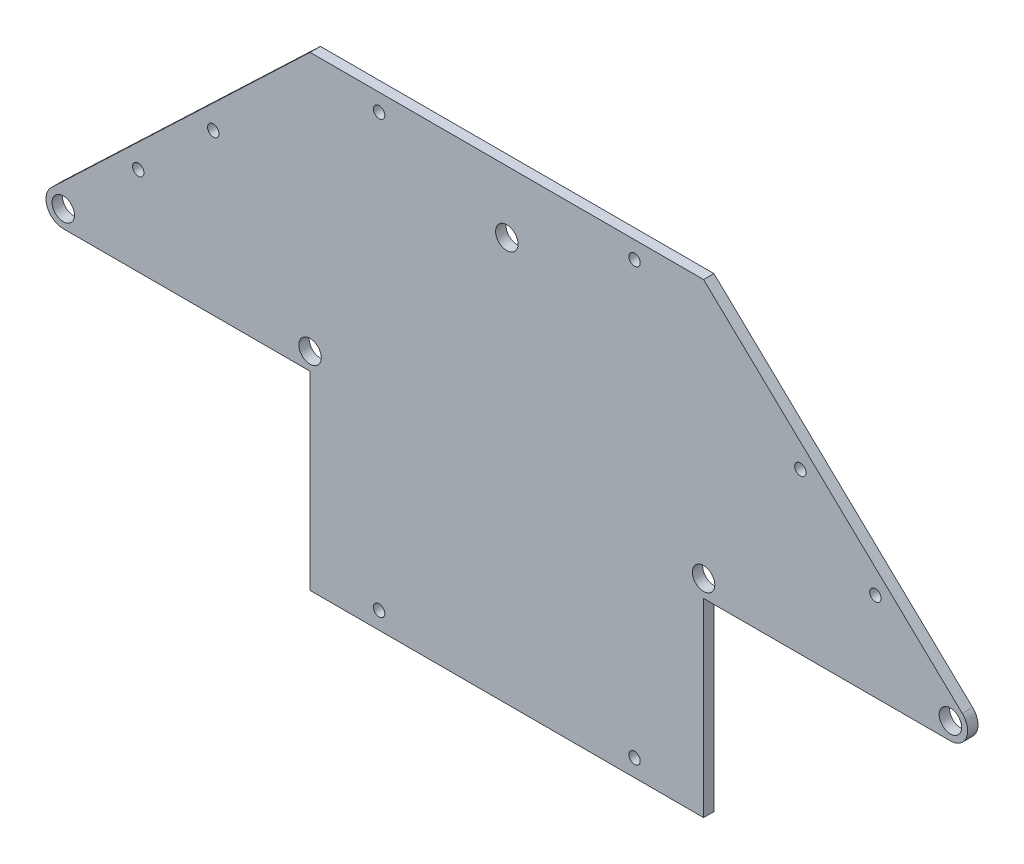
ISO-10303-21;
HEADER;
FILE_DESCRIPTION(('STEP AP214'),'2;1');
FILE_NAME('part.step','',(''),(''),'','','');
FILE_SCHEMA(('AUTOMOTIVE_DESIGN { 1 0 10303 214 1 1 1 1 }'));
ENDSEC;
DATA;
#1=APPLICATION_CONTEXT('core data for automotive mechanical design processes');
#2=APPLICATION_PROTOCOL_DEFINITION('international standard','automotive_design',2000,#1);
#3=PRODUCT_CONTEXT('',#1,'mechanical');
#4=PRODUCT('Part','Part','',(#3));
#5=PRODUCT_RELATED_PRODUCT_CATEGORY('part','',(#4));
#6=PRODUCT_DEFINITION_FORMATION('','',#4);
#7=PRODUCT_DEFINITION_CONTEXT('part definition',#1,'design');
#8=PRODUCT_DEFINITION('design','',#6,#7);
#9=PRODUCT_DEFINITION_SHAPE('','',#8);
#10=(LENGTH_UNIT() NAMED_UNIT(*) SI_UNIT(.MILLI.,.METRE.));
#11=(NAMED_UNIT(*) PLANE_ANGLE_UNIT() SI_UNIT($,.RADIAN.));
#12=(NAMED_UNIT(*) SI_UNIT($,.STERADIAN.) SOLID_ANGLE_UNIT());
#13=UNCERTAINTY_MEASURE_WITH_UNIT(LENGTH_MEASURE(1.E-05),#10,'distance_accuracy_value','');
#14=(GEOMETRIC_REPRESENTATION_CONTEXT(3) GLOBAL_UNCERTAINTY_ASSIGNED_CONTEXT((#13)) GLOBAL_UNIT_ASSIGNED_CONTEXT((#10,
#11,#12)) REPRESENTATION_CONTEXT('',''));
#15=CARTESIAN_POINT('',(0.,0.,0.));
#16=DIRECTION('',(0.,0.,1.));
#17=DIRECTION('',(1.,0.,0.));
#18=AXIS2_PLACEMENT_3D('',#15,#16,#17);
#19=CARTESIAN_POINT('',(0.,0.,3.));
#20=DIRECTION('',(0.,0.,-1.));
#21=DIRECTION('',(-1.,0.,0.));
#22=AXIS2_PLACEMENT_3D('',#19,#20,#21);
#23=PLANE('',#22);
#24=CARTESIAN_POINT('',(21.7241379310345,20.6896551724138,3.));
#25=DIRECTION('',(0.,0.,1.));
#26=DIRECTION('',(1.,0.,0.));
#27=AXIS2_PLACEMENT_3D('',#24,#25,#26);
#28=CIRCLE('',#27,1.65);
#29=CARTESIAN_POINT('',(23.3741379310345,20.6896551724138,3.));
#30=VERTEX_POINT('',#29);
#31=EDGE_CURVE('E270',#30,#30,#28,.T.);
#32=ORIENTED_EDGE('',*,*,#31,.F.);
#33=EDGE_LOOP('',(#32));
#34=FACE_BOUND('',#33,.T.);
#35=CARTESIAN_POINT('',(91.5,-55.,3.));
#36=DIRECTION('',(0.,0.,1.));
#37=DIRECTION('',(1.,0.,0.));
#38=AXIS2_PLACEMENT_3D('',#35,#36,#37);
#39=CIRCLE('',#38,1.65);
#40=CARTESIAN_POINT('',(93.15,-55.,3.));
#41=VERTEX_POINT('',#40);
#42=EDGE_CURVE('E258',#41,#41,#39,.T.);
#43=ORIENTED_EDGE('',*,*,#42,.F.);
#44=EDGE_LOOP('',(#43));
#45=FACE_BOUND('',#44,.T.);
#46=CARTESIAN_POINT('',(165.5,70.,3.));
#47=DIRECTION('',(0.,0.,1.));
#48=DIRECTION('',(1.,0.,0.));
#49=AXIS2_PLACEMENT_3D('',#46,#47,#48);
#50=CIRCLE('',#49,1.65000000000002);
#51=CARTESIAN_POINT('',(167.15,70.,3.));
#52=VERTEX_POINT('',#51);
#53=EDGE_CURVE('E246',#52,#52,#50,.T.);
#54=ORIENTED_EDGE('',*,*,#53,.F.);
#55=EDGE_LOOP('',(#54));
#56=FACE_BOUND('',#55,.T.);
#57=CARTESIAN_POINT('',(43.448275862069,41.3793103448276,3.));
#58=DIRECTION('',(0.,0.,1.));
#59=DIRECTION('',(1.,0.,0.));
#60=AXIS2_PLACEMENT_3D('',#57,#58,#59);
#61=CIRCLE('',#60,1.65);
#62=CARTESIAN_POINT('',(45.098275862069,41.3793103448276,3.));
#63=VERTEX_POINT('',#62);
#64=EDGE_CURVE('E234',#63,#63,#61,.T.);
#65=ORIENTED_EDGE('',*,*,#64,.F.);
#66=EDGE_LOOP('',(#65));
#67=FACE_BOUND('',#66,.T.);
#68=CARTESIAN_POINT('',(185.5,0.,3.));
#69=DIRECTION('',(0.,0.,1.));
#70=DIRECTION('',(1.,0.,0.));
#71=AXIS2_PLACEMENT_3D('',#68,#69,#70);
#72=CIRCLE('',#71,3.25000000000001);
#73=CARTESIAN_POINT('',(188.75,0.,3.));
#74=VERTEX_POINT('',#73);
#75=EDGE_CURVE('E222',#74,#74,#72,.T.);
#76=ORIENTED_EDGE('',*,*,#75,.F.);
#77=EDGE_LOOP('',(#76));
#78=FACE_BOUND('',#77,.T.);
#79=CARTESIAN_POINT('',(257.,0.,3.));
#80=DIRECTION('',(0.,0.,1.));
#81=DIRECTION('',(1.,0.,0.));
#82=AXIS2_PLACEMENT_3D('',#79,#80,#81);
#83=CIRCLE('',#82,3.24999999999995);
#84=CARTESIAN_POINT('',(260.25,0.,3.));
#85=VERTEX_POINT('',#84);
#86=EDGE_CURVE('E210',#85,#85,#83,.T.);
#87=ORIENTED_EDGE('',*,*,#86,.F.);
#88=EDGE_LOOP('',(#87));
#89=FACE_BOUND('',#88,.T.);
#90=CARTESIAN_POINT('',(0.,0.,3.));
#91=DIRECTION('',(0.,0.,1.));
#92=DIRECTION('',(-1.,0.,0.));
#93=AXIS2_PLACEMENT_3D('',#90,#91,#92);
#94=CIRCLE('',#93,5.);
#95=CARTESIAN_POINT('',(-3.44827586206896,3.62068965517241,3.));
#96=VERTEX_POINT('',#95);
#97=CARTESIAN_POINT('',(0.,-5.,3.));
#98=VERTEX_POINT('',#97);
#99=EDGE_CURVE('E159',#96,#98,#94,.T.);
#100=ORIENTED_EDGE('',*,*,#99,.T.);
#101=DIRECTION('',(1.,0.,0.));
#102=VECTOR('',#101,1.);
#103=CARTESIAN_POINT('',(0.,-5.,3.));
#104=LINE('',#103,#102);
#105=CARTESIAN_POINT('',(71.5,-5.,3.));
#106=VERTEX_POINT('',#105);
#107=EDGE_CURVE('E97',#98,#106,#104,.T.);
#108=ORIENTED_EDGE('',*,*,#107,.T.);
#109=DIRECTION('',(0.,-1.,0.));
#110=VECTOR('',#109,1.);
#111=CARTESIAN_POINT('',(71.5,-5.,3.));
#112=LINE('',#111,#110);
#113=CARTESIAN_POINT('',(71.5,-60.,3.));
#114=VERTEX_POINT('',#113);
#115=EDGE_CURVE('E180',#106,#114,#112,.T.);
#116=ORIENTED_EDGE('',*,*,#115,.T.);
#117=DIRECTION('',(1.,0.,0.));
#118=VECTOR('',#117,1.);
#119=CARTESIAN_POINT('',(71.5,-60.,3.));
#120=LINE('',#119,#118);
#121=CARTESIAN_POINT('',(185.5,-60.,3.));
#122=VERTEX_POINT('',#121);
#123=EDGE_CURVE('E199',#114,#122,#120,.T.);
#124=ORIENTED_EDGE('',*,*,#123,.T.);
#125=DIRECTION('',(0.,1.,0.));
#126=VECTOR('',#125,1.);
#127=CARTESIAN_POINT('',(185.5,-60.,3.));
#128=LINE('',#127,#126);
#129=CARTESIAN_POINT('',(185.5,-5.,3.));
#130=VERTEX_POINT('',#129);
#131=EDGE_CURVE('E196',#122,#130,#128,.T.);
#132=ORIENTED_EDGE('',*,*,#131,.T.);
#133=DIRECTION('',(1.,0.,0.));
#134=VECTOR('',#133,1.);
#135=CARTESIAN_POINT('',(185.5,-5.,3.));
#136=LINE('',#135,#134);
#137=CARTESIAN_POINT('',(257.,-5.,3.));
#138=VERTEX_POINT('',#137);
#139=EDGE_CURVE('E198',#130,#138,#136,.T.);
#140=ORIENTED_EDGE('',*,*,#139,.T.);
#141=CARTESIAN_POINT('',(257.,0.,3.));
#142=DIRECTION('',(0.,0.,1.));
#143=DIRECTION('',(1.,0.,0.));
#144=AXIS2_PLACEMENT_3D('',#141,#142,#143);
#145=CIRCLE('',#144,5.00000000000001);
#146=CARTESIAN_POINT('',(260.448275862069,3.62068965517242,3.));
#147=VERTEX_POINT('',#146);
#148=EDGE_CURVE('E122',#138,#147,#145,.T.);
#149=ORIENTED_EDGE('',*,*,#148,.T.);
#150=DIRECTION('',(-0.724137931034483,0.689655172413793,0.));
#151=VECTOR('',#150,1.);
#152=CARTESIAN_POINT('',(185.5,75.,3.));
#153=LINE('',#152,#151);
#154=CARTESIAN_POINT('',(185.5,75.,3.));
#155=VERTEX_POINT('',#154);
#156=EDGE_CURVE('E116',#147,#155,#153,.T.);
#157=ORIENTED_EDGE('',*,*,#156,.T.);
#158=DIRECTION('',(-1.,0.,0.));
#159=VECTOR('',#158,1.);
#160=CARTESIAN_POINT('',(71.5,75.,3.));
#161=LINE('',#160,#159);
#162=CARTESIAN_POINT('',(71.5,75.,3.));
#163=VERTEX_POINT('',#162);
#164=EDGE_CURVE('E120',#155,#163,#161,.T.);
#165=ORIENTED_EDGE('',*,*,#164,.T.);
#166=DIRECTION('',(-0.724137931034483,-0.689655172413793,0.));
#167=VECTOR('',#166,1.);
#168=CARTESIAN_POINT('',(71.5,75.,3.));
#169=LINE('',#168,#167);
#170=EDGE_CURVE('E48',#163,#96,#169,.T.);
#171=ORIENTED_EDGE('',*,*,#170,.T.);
#172=EDGE_LOOP('',(#100,#108,#116,#124,#132,#140,#149,#157,#165,#171));
#173=FACE_BOUND('',#172,.T.);
#174=CARTESIAN_POINT('',(0.,0.,3.));
#175=DIRECTION('',(0.,0.,1.));
#176=DIRECTION('',(1.,0.,0.));
#177=AXIS2_PLACEMENT_3D('',#174,#175,#176);
#178=CIRCLE('',#177,3.25);
#179=CARTESIAN_POINT('',(3.25,0.,3.));
#180=VERTEX_POINT('',#179);
#181=EDGE_CURVE('E144',#180,#180,#178,.T.);
#182=ORIENTED_EDGE('',*,*,#181,.F.);
#183=EDGE_LOOP('',(#182));
#184=FACE_BOUND('',#183,.T.);
#185=CARTESIAN_POINT('',(71.5,0.,3.));
#186=DIRECTION('',(0.,0.,1.));
#187=DIRECTION('',(1.,0.,0.));
#188=AXIS2_PLACEMENT_3D('',#185,#186,#187);
#189=CIRCLE('',#188,3.25000000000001);
#190=CARTESIAN_POINT('',(74.75,0.,3.));
#191=VERTEX_POINT('',#190);
#192=EDGE_CURVE('E216',#191,#191,#189,.T.);
#193=ORIENTED_EDGE('',*,*,#192,.F.);
#194=EDGE_LOOP('',(#193));
#195=FACE_BOUND('',#194,.T.);
#196=CARTESIAN_POINT('',(128.5,57.,3.));
#197=DIRECTION('',(0.,0.,1.));
#198=DIRECTION('',(1.,0.,0.));
#199=AXIS2_PLACEMENT_3D('',#196,#197,#198);
#200=CIRCLE('',#199,3.25000000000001);
#201=CARTESIAN_POINT('',(131.75,57.,3.));
#202=VERTEX_POINT('',#201);
#203=EDGE_CURVE('E228',#202,#202,#200,.T.);
#204=ORIENTED_EDGE('',*,*,#203,.F.);
#205=EDGE_LOOP('',(#204));
#206=FACE_BOUND('',#205,.T.);
#207=CARTESIAN_POINT('',(91.5,70.,3.));
#208=DIRECTION('',(0.,0.,1.));
#209=DIRECTION('',(1.,0.,0.));
#210=AXIS2_PLACEMENT_3D('',#207,#208,#209);
#211=CIRCLE('',#210,1.65);
#212=CARTESIAN_POINT('',(93.15,70.,3.));
#213=VERTEX_POINT('',#212);
#214=EDGE_CURVE('E240',#213,#213,#211,.T.);
#215=ORIENTED_EDGE('',*,*,#214,.F.);
#216=EDGE_LOOP('',(#215));
#217=FACE_BOUND('',#216,.T.);
#218=CARTESIAN_POINT('',(213.551724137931,41.3793103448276,3.));
#219=DIRECTION('',(0.,0.,1.));
#220=DIRECTION('',(1.,0.,0.));
#221=AXIS2_PLACEMENT_3D('',#218,#219,#220);
#222=CIRCLE('',#221,1.65000000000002);
#223=CARTESIAN_POINT('',(215.201724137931,41.3793103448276,3.));
#224=VERTEX_POINT('',#223);
#225=EDGE_CURVE('E252',#224,#224,#222,.T.);
#226=ORIENTED_EDGE('',*,*,#225,.F.);
#227=EDGE_LOOP('',(#226));
#228=FACE_BOUND('',#227,.T.);
#229=CARTESIAN_POINT('',(165.5,-55.,3.));
#230=DIRECTION('',(0.,0.,1.));
#231=DIRECTION('',(1.,0.,0.));
#232=AXIS2_PLACEMENT_3D('',#229,#230,#231);
#233=CIRCLE('',#232,1.65000000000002);
#234=CARTESIAN_POINT('',(167.15,-55.,3.));
#235=VERTEX_POINT('',#234);
#236=EDGE_CURVE('E264',#235,#235,#233,.T.);
#237=ORIENTED_EDGE('',*,*,#236,.F.);
#238=EDGE_LOOP('',(#237));
#239=FACE_BOUND('',#238,.T.);
#240=CARTESIAN_POINT('',(235.275862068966,20.6896551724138,3.));
#241=DIRECTION('',(0.,0.,1.));
#242=DIRECTION('',(1.,0.,0.));
#243=AXIS2_PLACEMENT_3D('',#240,#241,#242);
#244=CIRCLE('',#243,1.65000000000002);
#245=CARTESIAN_POINT('',(236.925862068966,20.6896551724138,3.));
#246=VERTEX_POINT('',#245);
#247=EDGE_CURVE('E276',#246,#246,#244,.T.);
#248=ORIENTED_EDGE('',*,*,#247,.F.);
#249=EDGE_LOOP('',(#248));
#250=FACE_BOUND('',#249,.T.);
#251=ADVANCED_FACE('F31',(#34,#45,#56,#67,#78,#89,#173,#184,#195,#206,#217,#228,#239,#250),#23,.F.);
#252=CARTESIAN_POINT('',(0.,0.,0.));
#253=DIRECTION('',(0.,0.,-1.));
#254=DIRECTION('',(-1.,0.,0.));
#255=AXIS2_PLACEMENT_3D('',#252,#253,#254);
#256=PLANE('',#255);
#257=CARTESIAN_POINT('',(21.7241379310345,20.6896551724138,0.));
#258=DIRECTION('',(0.,0.,1.));
#259=DIRECTION('',(1.,0.,0.));
#260=AXIS2_PLACEMENT_3D('',#257,#258,#259);
#261=CIRCLE('',#260,1.65);
#262=CARTESIAN_POINT('',(23.3741379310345,20.6896551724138,0.));
#263=VERTEX_POINT('',#262);
#264=EDGE_CURVE('E273',#263,#263,#261,.T.);
#265=ORIENTED_EDGE('',*,*,#264,.T.);
#266=EDGE_LOOP('',(#265));
#267=FACE_BOUND('',#266,.T.);
#268=CARTESIAN_POINT('',(91.5,-55.,0.));
#269=DIRECTION('',(0.,0.,1.));
#270=DIRECTION('',(1.,0.,0.));
#271=AXIS2_PLACEMENT_3D('',#268,#269,#270);
#272=CIRCLE('',#271,1.65);
#273=CARTESIAN_POINT('',(93.15,-55.,0.));
#274=VERTEX_POINT('',#273);
#275=EDGE_CURVE('E261',#274,#274,#272,.T.);
#276=ORIENTED_EDGE('',*,*,#275,.T.);
#277=EDGE_LOOP('',(#276));
#278=FACE_BOUND('',#277,.T.);
#279=CARTESIAN_POINT('',(165.5,70.,0.));
#280=DIRECTION('',(0.,0.,1.));
#281=DIRECTION('',(1.,0.,0.));
#282=AXIS2_PLACEMENT_3D('',#279,#280,#281);
#283=CIRCLE('',#282,1.65000000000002);
#284=CARTESIAN_POINT('',(167.15,70.,0.));
#285=VERTEX_POINT('',#284);
#286=EDGE_CURVE('E249',#285,#285,#283,.T.);
#287=ORIENTED_EDGE('',*,*,#286,.T.);
#288=EDGE_LOOP('',(#287));
#289=FACE_BOUND('',#288,.T.);
#290=CARTESIAN_POINT('',(43.448275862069,41.3793103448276,0.));
#291=DIRECTION('',(0.,0.,1.));
#292=DIRECTION('',(1.,0.,0.));
#293=AXIS2_PLACEMENT_3D('',#290,#291,#292);
#294=CIRCLE('',#293,1.65);
#295=CARTESIAN_POINT('',(45.098275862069,41.3793103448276,0.));
#296=VERTEX_POINT('',#295);
#297=EDGE_CURVE('E237',#296,#296,#294,.T.);
#298=ORIENTED_EDGE('',*,*,#297,.T.);
#299=EDGE_LOOP('',(#298));
#300=FACE_BOUND('',#299,.T.);
#301=CARTESIAN_POINT('',(185.5,0.,0.));
#302=DIRECTION('',(0.,0.,1.));
#303=DIRECTION('',(1.,0.,0.));
#304=AXIS2_PLACEMENT_3D('',#301,#302,#303);
#305=CIRCLE('',#304,3.25000000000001);
#306=CARTESIAN_POINT('',(188.75,0.,0.));
#307=VERTEX_POINT('',#306);
#308=EDGE_CURVE('E225',#307,#307,#305,.T.);
#309=ORIENTED_EDGE('',*,*,#308,.T.);
#310=EDGE_LOOP('',(#309));
#311=FACE_BOUND('',#310,.T.);
#312=CARTESIAN_POINT('',(257.,0.,0.));
#313=DIRECTION('',(0.,0.,1.));
#314=DIRECTION('',(1.,0.,0.));
#315=AXIS2_PLACEMENT_3D('',#312,#313,#314);
#316=CIRCLE('',#315,3.24999999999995);
#317=CARTESIAN_POINT('',(260.25,0.,0.));
#318=VERTEX_POINT('',#317);
#319=EDGE_CURVE('E213',#318,#318,#316,.T.);
#320=ORIENTED_EDGE('',*,*,#319,.T.);
#321=EDGE_LOOP('',(#320));
#322=FACE_BOUND('',#321,.T.);
#323=CARTESIAN_POINT('',(0.,0.,0.));
#324=DIRECTION('',(0.,0.,1.));
#325=DIRECTION('',(-1.,0.,0.));
#326=AXIS2_PLACEMENT_3D('',#323,#324,#325);
#327=CIRCLE('',#326,5.);
#328=CARTESIAN_POINT('',(-3.44827586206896,3.62068965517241,0.));
#329=VERTEX_POINT('',#328);
#330=CARTESIAN_POINT('',(0.,-5.,0.));
#331=VERTEX_POINT('',#330);
#332=EDGE_CURVE('E140',#329,#331,#327,.T.);
#333=ORIENTED_EDGE('',*,*,#332,.F.);
#334=DIRECTION('',(-0.724137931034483,-0.689655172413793,0.));
#335=VECTOR('',#334,1.);
#336=CARTESIAN_POINT('',(71.5,75.,0.));
#337=LINE('',#336,#335);
#338=CARTESIAN_POINT('',(71.5,75.,0.));
#339=VERTEX_POINT('',#338);
#340=EDGE_CURVE('E89',#339,#329,#337,.T.);
#341=ORIENTED_EDGE('',*,*,#340,.F.);
#342=DIRECTION('',(-1.,0.,0.));
#343=VECTOR('',#342,1.);
#344=CARTESIAN_POINT('',(71.5,75.,0.));
#345=LINE('',#344,#343);
#346=CARTESIAN_POINT('',(185.5,75.,0.));
#347=VERTEX_POINT('',#346);
#348=EDGE_CURVE('E83',#347,#339,#345,.T.);
#349=ORIENTED_EDGE('',*,*,#348,.F.);
#350=DIRECTION('',(-0.724137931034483,0.689655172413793,0.));
#351=VECTOR('',#350,1.);
#352=CARTESIAN_POINT('',(185.5,75.,0.));
#353=LINE('',#352,#351);
#354=CARTESIAN_POINT('',(260.448275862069,3.62068965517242,0.));
#355=VERTEX_POINT('',#354);
#356=EDGE_CURVE('E130',#355,#347,#353,.T.);
#357=ORIENTED_EDGE('',*,*,#356,.F.);
#358=CARTESIAN_POINT('',(257.,0.,0.));
#359=DIRECTION('',(0.,0.,1.));
#360=DIRECTION('',(1.,0.,0.));
#361=AXIS2_PLACEMENT_3D('',#358,#359,#360);
#362=CIRCLE('',#361,5.00000000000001);
#363=CARTESIAN_POINT('',(257.,-5.,0.));
#364=VERTEX_POINT('',#363);
#365=EDGE_CURVE('E154',#364,#355,#362,.T.);
#366=ORIENTED_EDGE('',*,*,#365,.F.);
#367=DIRECTION('',(1.,0.,0.));
#368=VECTOR('',#367,1.);
#369=CARTESIAN_POINT('',(185.5,-5.,0.));
#370=LINE('',#369,#368);
#371=CARTESIAN_POINT('',(185.5,-5.,0.));
#372=VERTEX_POINT('',#371);
#373=EDGE_CURVE('E152',#372,#364,#370,.T.);
#374=ORIENTED_EDGE('',*,*,#373,.F.);
#375=DIRECTION('',(0.,1.,0.));
#376=VECTOR('',#375,1.);
#377=CARTESIAN_POINT('',(185.5,-60.,0.));
#378=LINE('',#377,#376);
#379=CARTESIAN_POINT('',(185.5,-60.,0.));
#380=VERTEX_POINT('',#379);
#381=EDGE_CURVE('E150',#380,#372,#378,.T.);
#382=ORIENTED_EDGE('',*,*,#381,.F.);
#383=DIRECTION('',(1.,0.,0.));
#384=VECTOR('',#383,1.);
#385=CARTESIAN_POINT('',(71.5,-60.,0.));
#386=LINE('',#385,#384);
#387=CARTESIAN_POINT('',(71.5,-60.,0.));
#388=VERTEX_POINT('',#387);
#389=EDGE_CURVE('E148',#388,#380,#386,.T.);
#390=ORIENTED_EDGE('',*,*,#389,.F.);
#391=DIRECTION('',(0.,-1.,0.));
#392=VECTOR('',#391,1.);
#393=CARTESIAN_POINT('',(71.5,-5.,0.));
#394=LINE('',#393,#392);
#395=CARTESIAN_POINT('',(71.5,-5.,0.));
#396=VERTEX_POINT('',#395);
#397=EDGE_CURVE('E146',#396,#388,#394,.T.);
#398=ORIENTED_EDGE('',*,*,#397,.F.);
#399=DIRECTION('',(1.,0.,0.));
#400=VECTOR('',#399,1.);
#401=CARTESIAN_POINT('',(0.,-5.,0.));
#402=LINE('',#401,#400);
#403=EDGE_CURVE('E143',#331,#396,#402,.T.);
#404=ORIENTED_EDGE('',*,*,#403,.F.);
#405=EDGE_LOOP('',(#333,#341,#349,#357,#366,#374,#382,#390,#398,#404));
#406=FACE_BOUND('',#405,.T.);
#407=CARTESIAN_POINT('',(0.,0.,0.));
#408=DIRECTION('',(0.,0.,1.));
#409=DIRECTION('',(1.,0.,0.));
#410=AXIS2_PLACEMENT_3D('',#407,#408,#409);
#411=CIRCLE('',#410,3.25);
#412=CARTESIAN_POINT('',(3.25,0.,0.));
#413=VERTEX_POINT('',#412);
#414=EDGE_CURVE('E207',#413,#413,#411,.T.);
#415=ORIENTED_EDGE('',*,*,#414,.T.);
#416=EDGE_LOOP('',(#415));
#417=FACE_BOUND('',#416,.T.);
#418=CARTESIAN_POINT('',(71.5,0.,0.));
#419=DIRECTION('',(0.,0.,1.));
#420=DIRECTION('',(1.,0.,0.));
#421=AXIS2_PLACEMENT_3D('',#418,#419,#420);
#422=CIRCLE('',#421,3.25000000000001);
#423=CARTESIAN_POINT('',(74.75,0.,0.));
#424=VERTEX_POINT('',#423);
#425=EDGE_CURVE('E219',#424,#424,#422,.T.);
#426=ORIENTED_EDGE('',*,*,#425,.T.);
#427=EDGE_LOOP('',(#426));
#428=FACE_BOUND('',#427,.T.);
#429=CARTESIAN_POINT('',(128.5,57.,0.));
#430=DIRECTION('',(0.,0.,1.));
#431=DIRECTION('',(1.,0.,0.));
#432=AXIS2_PLACEMENT_3D('',#429,#430,#431);
#433=CIRCLE('',#432,3.25000000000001);
#434=CARTESIAN_POINT('',(131.75,57.,0.));
#435=VERTEX_POINT('',#434);
#436=EDGE_CURVE('E231',#435,#435,#433,.T.);
#437=ORIENTED_EDGE('',*,*,#436,.T.);
#438=EDGE_LOOP('',(#437));
#439=FACE_BOUND('',#438,.T.);
#440=CARTESIAN_POINT('',(91.5,70.,0.));
#441=DIRECTION('',(0.,0.,1.));
#442=DIRECTION('',(1.,0.,0.));
#443=AXIS2_PLACEMENT_3D('',#440,#441,#442);
#444=CIRCLE('',#443,1.65);
#445=CARTESIAN_POINT('',(93.15,70.,0.));
#446=VERTEX_POINT('',#445);
#447=EDGE_CURVE('E243',#446,#446,#444,.T.);
#448=ORIENTED_EDGE('',*,*,#447,.T.);
#449=EDGE_LOOP('',(#448));
#450=FACE_BOUND('',#449,.T.);
#451=CARTESIAN_POINT('',(213.551724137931,41.3793103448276,0.));
#452=DIRECTION('',(0.,0.,1.));
#453=DIRECTION('',(1.,0.,0.));
#454=AXIS2_PLACEMENT_3D('',#451,#452,#453);
#455=CIRCLE('',#454,1.65000000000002);
#456=CARTESIAN_POINT('',(215.201724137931,41.3793103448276,0.));
#457=VERTEX_POINT('',#456);
#458=EDGE_CURVE('E255',#457,#457,#455,.T.);
#459=ORIENTED_EDGE('',*,*,#458,.T.);
#460=EDGE_LOOP('',(#459));
#461=FACE_BOUND('',#460,.T.);
#462=CARTESIAN_POINT('',(165.5,-55.,0.));
#463=DIRECTION('',(0.,0.,1.));
#464=DIRECTION('',(1.,0.,0.));
#465=AXIS2_PLACEMENT_3D('',#462,#463,#464);
#466=CIRCLE('',#465,1.65000000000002);
#467=CARTESIAN_POINT('',(167.15,-55.,0.));
#468=VERTEX_POINT('',#467);
#469=EDGE_CURVE('E267',#468,#468,#466,.T.);
#470=ORIENTED_EDGE('',*,*,#469,.T.);
#471=EDGE_LOOP('',(#470));
#472=FACE_BOUND('',#471,.T.);
#473=CARTESIAN_POINT('',(235.275862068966,20.6896551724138,0.));
#474=DIRECTION('',(0.,0.,1.));
#475=DIRECTION('',(1.,0.,0.));
#476=AXIS2_PLACEMENT_3D('',#473,#474,#475);
#477=CIRCLE('',#476,1.65000000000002);
#478=CARTESIAN_POINT('',(236.925862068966,20.6896551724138,0.));
#479=VERTEX_POINT('',#478);
#480=EDGE_CURVE('E279',#479,#479,#477,.T.);
#481=ORIENTED_EDGE('',*,*,#480,.T.);
#482=EDGE_LOOP('',(#481));
#483=FACE_BOUND('',#482,.T.);
#484=ADVANCED_FACE('F184',(#267,#278,#289,#300,#311,#322,#406,#417,#428,#439,#450,#461,#472,
#483),#256,.T.);
#485=CARTESIAN_POINT('',(0.,0.,3.));
#486=DIRECTION('',(0.,0.,-1.));
#487=DIRECTION('',(-1.,0.,0.));
#488=AXIS2_PLACEMENT_3D('',#485,#486,#487);
#489=CYLINDRICAL_SURFACE('',#488,5.);
#490=ORIENTED_EDGE('',*,*,#332,.T.);
#491=DIRECTION('',(0.,0.,-1.));
#492=VECTOR('',#491,1.);
#493=CARTESIAN_POINT('',(0.,-5.,3.));
#494=LINE('',#493,#492);
#495=EDGE_CURVE('E11',#98,#331,#494,.T.);
#496=ORIENTED_EDGE('',*,*,#495,.F.);
#497=ORIENTED_EDGE('',*,*,#99,.F.);
#498=DIRECTION('',(0.,0.,-1.));
#499=VECTOR('',#498,1.);
#500=CARTESIAN_POINT('',(-3.44827586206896,3.62068965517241,3.));
#501=LINE('',#500,#499);
#502=EDGE_CURVE('E136',#96,#329,#501,.T.);
#503=ORIENTED_EDGE('',*,*,#502,.T.);
#504=EDGE_LOOP('',(#490,#496,#497,#503));
#505=FACE_BOUND('',#504,.T.);
#506=ADVANCED_FACE('F33',(#505),#489,.T.);
#507=CARTESIAN_POINT('',(0.,-5.,3.));
#508=DIRECTION('',(0.,1.,0.));
#509=DIRECTION('',(0.,0.,1.));
#510=AXIS2_PLACEMENT_3D('',#507,#508,#509);
#511=PLANE('',#510);
#512=ORIENTED_EDGE('',*,*,#403,.T.);
#513=DIRECTION('',(0.,0.,-1.));
#514=VECTOR('',#513,1.);
#515=CARTESIAN_POINT('',(71.5,-5.,3.));
#516=LINE('',#515,#514);
#517=EDGE_CURVE('E40',#106,#396,#516,.T.);
#518=ORIENTED_EDGE('',*,*,#517,.F.);
#519=ORIENTED_EDGE('',*,*,#107,.F.);
#520=ORIENTED_EDGE('',*,*,#495,.T.);
#521=EDGE_LOOP('',(#512,#518,#519,#520));
#522=FACE_BOUND('',#521,.T.);
#523=ADVANCED_FACE('F322',(#522),#511,.F.);
#524=CARTESIAN_POINT('',(71.5,-5.,3.));
#525=DIRECTION('',(1.,0.,0.));
#526=DIRECTION('',(0.,0.,-1.));
#527=AXIS2_PLACEMENT_3D('',#524,#525,#526);
#528=PLANE('',#527);
#529=ORIENTED_EDGE('',*,*,#397,.T.);
#530=DIRECTION('',(0.,0.,-1.));
#531=VECTOR('',#530,1.);
#532=CARTESIAN_POINT('',(71.5,-60.,3.));
#533=LINE('',#532,#531);
#534=EDGE_CURVE('E172',#114,#388,#533,.T.);
#535=ORIENTED_EDGE('',*,*,#534,.F.);
#536=ORIENTED_EDGE('',*,*,#115,.F.);
#537=ORIENTED_EDGE('',*,*,#517,.T.);
#538=EDGE_LOOP('',(#529,#535,#536,#537));
#539=FACE_BOUND('',#538,.T.);
#540=ADVANCED_FACE('F178',(#539),#528,.F.);
#541=CARTESIAN_POINT('',(71.5,-60.,3.));
#542=DIRECTION('',(0.,1.,0.));
#543=DIRECTION('',(0.,0.,1.));
#544=AXIS2_PLACEMENT_3D('',#541,#542,#543);
#545=PLANE('',#544);
#546=ORIENTED_EDGE('',*,*,#389,.T.);
#547=DIRECTION('',(0.,0.,-1.));
#548=VECTOR('',#547,1.);
#549=CARTESIAN_POINT('',(185.5,-60.,3.));
#550=LINE('',#549,#548);
#551=EDGE_CURVE('E169',#122,#380,#550,.T.);
#552=ORIENTED_EDGE('',*,*,#551,.F.);
#553=ORIENTED_EDGE('',*,*,#123,.F.);
#554=ORIENTED_EDGE('',*,*,#534,.T.);
#555=EDGE_LOOP('',(#546,#552,#553,#554));
#556=FACE_BOUND('',#555,.T.);
#557=ADVANCED_FACE('F190',(#556),#545,.F.);
#558=CARTESIAN_POINT('',(185.5,-60.,3.));
#559=DIRECTION('',(-1.,0.,0.));
#560=DIRECTION('',(0.,0.,1.));
#561=AXIS2_PLACEMENT_3D('',#558,#559,#560);
#562=PLANE('',#561);
#563=ORIENTED_EDGE('',*,*,#381,.T.);
#564=DIRECTION('',(0.,0.,-1.));
#565=VECTOR('',#564,1.);
#566=CARTESIAN_POINT('',(185.5,-5.,3.));
#567=LINE('',#566,#565);
#568=EDGE_CURVE('E166',#130,#372,#567,.T.);
#569=ORIENTED_EDGE('',*,*,#568,.F.);
#570=ORIENTED_EDGE('',*,*,#131,.F.);
#571=ORIENTED_EDGE('',*,*,#551,.T.);
#572=EDGE_LOOP('',(#563,#569,#570,#571));
#573=FACE_BOUND('',#572,.T.);
#574=ADVANCED_FACE('F194',(#573),#562,.F.);
#575=CARTESIAN_POINT('',(185.5,-5.,3.));
#576=DIRECTION('',(0.,1.,0.));
#577=DIRECTION('',(-1.,0.,0.));
#578=AXIS2_PLACEMENT_3D('',#575,#576,#577);
#579=PLANE('',#578);
#580=ORIENTED_EDGE('',*,*,#373,.T.);
#581=DIRECTION('',(0.,0.,-1.));
#582=VECTOR('',#581,1.);
#583=CARTESIAN_POINT('',(257.,-5.,3.));
#584=LINE('',#583,#582);
#585=EDGE_CURVE('E163',#138,#364,#584,.T.);
#586=ORIENTED_EDGE('',*,*,#585,.F.);
#587=ORIENTED_EDGE('',*,*,#139,.F.);
#588=ORIENTED_EDGE('',*,*,#568,.T.);
#589=EDGE_LOOP('',(#580,#586,#587,#588));
#590=FACE_BOUND('',#589,.T.);
#591=ADVANCED_FACE('F312',(#590),#579,.F.);
#592=CARTESIAN_POINT('',(257.,0.,3.));
#593=DIRECTION('',(0.,0.,-1.));
#594=DIRECTION('',(-1.,0.,0.));
#595=AXIS2_PLACEMENT_3D('',#592,#593,#594);
#596=CYLINDRICAL_SURFACE('',#595,5.00000000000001);
#597=ORIENTED_EDGE('',*,*,#365,.T.);
#598=DIRECTION('',(0.,0.,-1.));
#599=VECTOR('',#598,1.);
#600=CARTESIAN_POINT('',(260.448275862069,3.62068965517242,3.));
#601=LINE('',#600,#599);
#602=EDGE_CURVE('E131',#147,#355,#601,.T.);
#603=ORIENTED_EDGE('',*,*,#602,.F.);
#604=ORIENTED_EDGE('',*,*,#148,.F.);
#605=ORIENTED_EDGE('',*,*,#585,.T.);
#606=EDGE_LOOP('',(#597,#603,#604,#605));
#607=FACE_BOUND('',#606,.T.);
#608=ADVANCED_FACE('F309',(#607),#596,.T.);
#609=CARTESIAN_POINT('',(185.5,75.,3.));
#610=DIRECTION('',(-0.689655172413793,-0.724137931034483,0.));
#611=DIRECTION('',(0.724137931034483,-0.689655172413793,0.));
#612=AXIS2_PLACEMENT_3D('',#609,#610,#611);
#613=PLANE('',#612);
#614=ORIENTED_EDGE('',*,*,#356,.T.);
#615=DIRECTION('',(0.,0.,-1.));
#616=VECTOR('',#615,1.);
#617=CARTESIAN_POINT('',(185.5,75.,3.));
#618=LINE('',#617,#616);
#619=EDGE_CURVE('E127',#155,#347,#618,.T.);
#620=ORIENTED_EDGE('',*,*,#619,.F.);
#621=ORIENTED_EDGE('',*,*,#156,.F.);
#622=ORIENTED_EDGE('',*,*,#602,.T.);
#623=EDGE_LOOP('',(#614,#620,#621,#622));
#624=FACE_BOUND('',#623,.T.);
#625=ADVANCED_FACE('F128',(#624),#613,.F.);
#626=CARTESIAN_POINT('',(71.5,75.,3.));
#627=DIRECTION('',(0.,-1.,0.));
#628=DIRECTION('',(0.,0.,-1.));
#629=AXIS2_PLACEMENT_3D('',#626,#627,#628);
#630=PLANE('',#629);
#631=ORIENTED_EDGE('',*,*,#348,.T.);
#632=DIRECTION('',(0.,0.,-1.));
#633=VECTOR('',#632,1.);
#634=CARTESIAN_POINT('',(71.5,75.,3.));
#635=LINE('',#634,#633);
#636=EDGE_CURVE('E132',#163,#339,#635,.T.);
#637=ORIENTED_EDGE('',*,*,#636,.F.);
#638=ORIENTED_EDGE('',*,*,#164,.F.);
#639=ORIENTED_EDGE('',*,*,#619,.T.);
#640=EDGE_LOOP('',(#631,#637,#638,#639));
#641=FACE_BOUND('',#640,.T.);
#642=ADVANCED_FACE('F134',(#641),#630,.F.);
#643=CARTESIAN_POINT('',(71.5,75.,3.));
#644=DIRECTION('',(0.689655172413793,-0.724137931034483,0.));
#645=DIRECTION('',(0.724137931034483,0.689655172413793,0.));
#646=AXIS2_PLACEMENT_3D('',#643,#644,#645);
#647=PLANE('',#646);
#648=ORIENTED_EDGE('',*,*,#340,.T.);
#649=ORIENTED_EDGE('',*,*,#502,.F.);
#650=ORIENTED_EDGE('',*,*,#170,.F.);
#651=ORIENTED_EDGE('',*,*,#636,.T.);
#652=EDGE_LOOP('',(#648,#649,#650,#651));
#653=FACE_BOUND('',#652,.T.);
#654=ADVANCED_FACE('F302',(#653),#647,.F.);
#655=CARTESIAN_POINT('',(0.,0.,3.));
#656=DIRECTION('',(0.,0.,-1.));
#657=DIRECTION('',(-1.,0.,0.));
#658=AXIS2_PLACEMENT_3D('',#655,#656,#657);
#659=CYLINDRICAL_SURFACE('',#658,3.25);
#660=ORIENTED_EDGE('',*,*,#181,.T.);
#661=EDGE_LOOP('',(#660));
#662=FACE_BOUND('',#661,.T.);
#663=ORIENTED_EDGE('',*,*,#414,.F.);
#664=EDGE_LOOP('',(#663));
#665=FACE_BOUND('',#664,.T.);
#666=ADVANCED_FACE('F299',(#662,#665),#659,.F.);
#667=CARTESIAN_POINT('',(257.,0.,3.));
#668=DIRECTION('',(0.,0.,-1.));
#669=DIRECTION('',(-1.,0.,0.));
#670=AXIS2_PLACEMENT_3D('',#667,#668,#669);
#671=CYLINDRICAL_SURFACE('',#670,3.24999999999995);
#672=ORIENTED_EDGE('',*,*,#86,.T.);
#673=EDGE_LOOP('',(#672));
#674=FACE_BOUND('',#673,.T.);
#675=ORIENTED_EDGE('',*,*,#319,.F.);
#676=EDGE_LOOP('',(#675));
#677=FACE_BOUND('',#676,.T.);
#678=ADVANCED_FACE('F398',(#674,#677),#671,.F.);
#679=CARTESIAN_POINT('',(71.5,0.,3.));
#680=DIRECTION('',(0.,0.,-1.));
#681=DIRECTION('',(-1.,0.,0.));
#682=AXIS2_PLACEMENT_3D('',#679,#680,#681);
#683=CYLINDRICAL_SURFACE('',#682,3.25000000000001);
#684=ORIENTED_EDGE('',*,*,#192,.T.);
#685=EDGE_LOOP('',(#684));
#686=FACE_BOUND('',#685,.T.);
#687=ORIENTED_EDGE('',*,*,#425,.F.);
#688=EDGE_LOOP('',(#687));
#689=FACE_BOUND('',#688,.T.);
#690=ADVANCED_FACE('F406',(#686,#689),#683,.F.);
#691=CARTESIAN_POINT('',(185.5,0.,3.));
#692=DIRECTION('',(0.,0.,-1.));
#693=DIRECTION('',(-1.,0.,0.));
#694=AXIS2_PLACEMENT_3D('',#691,#692,#693);
#695=CYLINDRICAL_SURFACE('',#694,3.25000000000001);
#696=ORIENTED_EDGE('',*,*,#75,.T.);
#697=EDGE_LOOP('',(#696));
#698=FACE_BOUND('',#697,.T.);
#699=ORIENTED_EDGE('',*,*,#308,.F.);
#700=EDGE_LOOP('',(#699));
#701=FACE_BOUND('',#700,.T.);
#702=ADVANCED_FACE('F414',(#698,#701),#695,.F.);
#703=CARTESIAN_POINT('',(128.5,57.,3.));
#704=DIRECTION('',(0.,0.,-1.));
#705=DIRECTION('',(-1.,0.,0.));
#706=AXIS2_PLACEMENT_3D('',#703,#704,#705);
#707=CYLINDRICAL_SURFACE('',#706,3.25000000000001);
#708=ORIENTED_EDGE('',*,*,#203,.T.);
#709=EDGE_LOOP('',(#708));
#710=FACE_BOUND('',#709,.T.);
#711=ORIENTED_EDGE('',*,*,#436,.F.);
#712=EDGE_LOOP('',(#711));
#713=FACE_BOUND('',#712,.T.);
#714=ADVANCED_FACE('F423',(#710,#713),#707,.F.);
#715=CARTESIAN_POINT('',(43.448275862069,41.3793103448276,3.));
#716=DIRECTION('',(0.,0.,-1.));
#717=DIRECTION('',(-1.,0.,0.));
#718=AXIS2_PLACEMENT_3D('',#715,#716,#717);
#719=CYLINDRICAL_SURFACE('',#718,1.65);
#720=ORIENTED_EDGE('',*,*,#64,.T.);
#721=EDGE_LOOP('',(#720));
#722=FACE_BOUND('',#721,.T.);
#723=ORIENTED_EDGE('',*,*,#297,.F.);
#724=EDGE_LOOP('',(#723));
#725=FACE_BOUND('',#724,.T.);
#726=ADVANCED_FACE('F432',(#722,#725),#719,.F.);
#727=CARTESIAN_POINT('',(91.5,70.,3.));
#728=DIRECTION('',(0.,0.,-1.));
#729=DIRECTION('',(-1.,0.,0.));
#730=AXIS2_PLACEMENT_3D('',#727,#728,#729);
#731=CYLINDRICAL_SURFACE('',#730,1.65);
#732=ORIENTED_EDGE('',*,*,#214,.T.);
#733=EDGE_LOOP('',(#732));
#734=FACE_BOUND('',#733,.T.);
#735=ORIENTED_EDGE('',*,*,#447,.F.);
#736=EDGE_LOOP('',(#735));
#737=FACE_BOUND('',#736,.T.);
#738=ADVANCED_FACE('F441',(#734,#737),#731,.F.);
#739=CARTESIAN_POINT('',(165.5,70.,3.));
#740=DIRECTION('',(0.,0.,-1.));
#741=DIRECTION('',(-1.,0.,0.));
#742=AXIS2_PLACEMENT_3D('',#739,#740,#741);
#743=CYLINDRICAL_SURFACE('',#742,1.65000000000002);
#744=ORIENTED_EDGE('',*,*,#53,.T.);
#745=EDGE_LOOP('',(#744));
#746=FACE_BOUND('',#745,.T.);
#747=ORIENTED_EDGE('',*,*,#286,.F.);
#748=EDGE_LOOP('',(#747));
#749=FACE_BOUND('',#748,.T.);
#750=ADVANCED_FACE('F450',(#746,#749),#743,.F.);
#751=CARTESIAN_POINT('',(213.551724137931,41.3793103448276,3.));
#752=DIRECTION('',(0.,0.,-1.));
#753=DIRECTION('',(-1.,0.,0.));
#754=AXIS2_PLACEMENT_3D('',#751,#752,#753);
#755=CYLINDRICAL_SURFACE('',#754,1.65000000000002);
#756=ORIENTED_EDGE('',*,*,#225,.T.);
#757=EDGE_LOOP('',(#756));
#758=FACE_BOUND('',#757,.T.);
#759=ORIENTED_EDGE('',*,*,#458,.F.);
#760=EDGE_LOOP('',(#759));
#761=FACE_BOUND('',#760,.T.);
#762=ADVANCED_FACE('F459',(#758,#761),#755,.F.);
#763=CARTESIAN_POINT('',(91.5,-55.,3.));
#764=DIRECTION('',(0.,0.,-1.));
#765=DIRECTION('',(-1.,0.,0.));
#766=AXIS2_PLACEMENT_3D('',#763,#764,#765);
#767=CYLINDRICAL_SURFACE('',#766,1.65);
#768=ORIENTED_EDGE('',*,*,#42,.T.);
#769=EDGE_LOOP('',(#768));
#770=FACE_BOUND('',#769,.T.);
#771=ORIENTED_EDGE('',*,*,#275,.F.);
#772=EDGE_LOOP('',(#771));
#773=FACE_BOUND('',#772,.T.);
#774=ADVANCED_FACE('F468',(#770,#773),#767,.F.);
#775=CARTESIAN_POINT('',(165.5,-55.,3.));
#776=DIRECTION('',(0.,0.,-1.));
#777=DIRECTION('',(-1.,0.,0.));
#778=AXIS2_PLACEMENT_3D('',#775,#776,#777);
#779=CYLINDRICAL_SURFACE('',#778,1.65000000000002);
#780=ORIENTED_EDGE('',*,*,#236,.T.);
#781=EDGE_LOOP('',(#780));
#782=FACE_BOUND('',#781,.T.);
#783=ORIENTED_EDGE('',*,*,#469,.F.);
#784=EDGE_LOOP('',(#783));
#785=FACE_BOUND('',#784,.T.);
#786=ADVANCED_FACE('F477',(#782,#785),#779,.F.);
#787=CARTESIAN_POINT('',(21.7241379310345,20.6896551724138,3.));
#788=DIRECTION('',(0.,0.,-1.));
#789=DIRECTION('',(-1.,0.,0.));
#790=AXIS2_PLACEMENT_3D('',#787,#788,#789);
#791=CYLINDRICAL_SURFACE('',#790,1.65);
#792=ORIENTED_EDGE('',*,*,#31,.T.);
#793=EDGE_LOOP('',(#792));
#794=FACE_BOUND('',#793,.T.);
#795=ORIENTED_EDGE('',*,*,#264,.F.);
#796=EDGE_LOOP('',(#795));
#797=FACE_BOUND('',#796,.T.);
#798=ADVANCED_FACE('F486',(#794,#797),#791,.F.);
#799=CARTESIAN_POINT('',(235.275862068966,20.6896551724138,3.));
#800=DIRECTION('',(0.,0.,-1.));
#801=DIRECTION('',(-1.,0.,0.));
#802=AXIS2_PLACEMENT_3D('',#799,#800,#801);
#803=CYLINDRICAL_SURFACE('',#802,1.65000000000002);
#804=ORIENTED_EDGE('',*,*,#247,.T.);
#805=EDGE_LOOP('',(#804));
#806=FACE_BOUND('',#805,.T.);
#807=ORIENTED_EDGE('',*,*,#480,.F.);
#808=EDGE_LOOP('',(#807));
#809=FACE_BOUND('',#808,.T.);
#810=ADVANCED_FACE('F285',(#806,#809),#803,.F.);
#811=CLOSED_SHELL('',(#251,#484,#506,#523,#540,#557,#574,#591,#608,#625,#642,#654,#666,#678,
#690,#702,#714,#726,#738,#750,#762,#774,#786,#798,#810));
#812=MANIFOLD_SOLID_BREP('B2',#811);
#813=ADVANCED_BREP_SHAPE_REPRESENTATION('',(#18,#812),#14);
#814=SHAPE_DEFINITION_REPRESENTATION(#9,#813);
ENDSEC;
END-ISO-10303-21;
